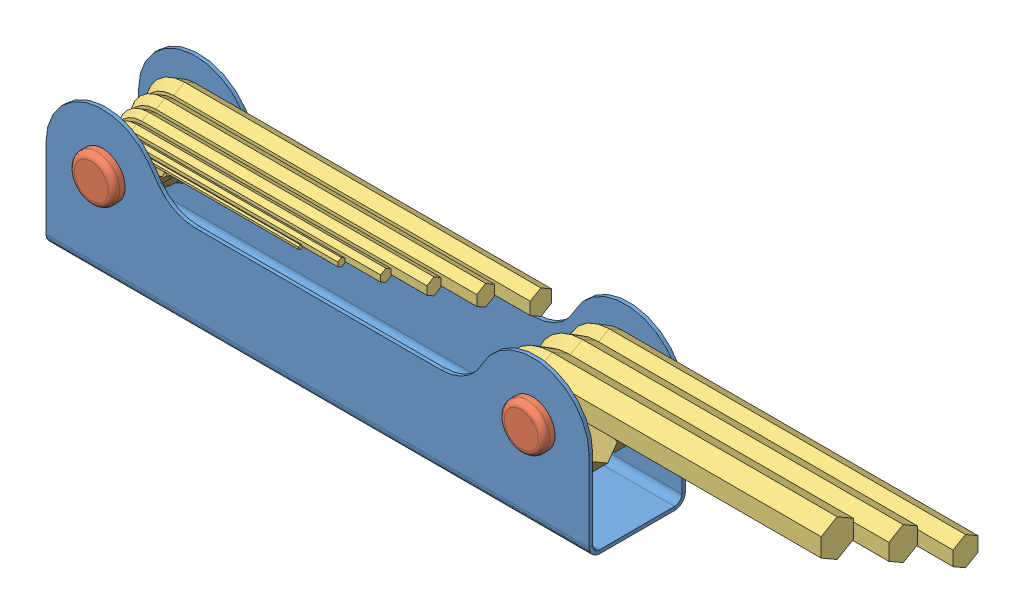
SolidWorks assembly part configs_&.SLDASM, configuration Exploded (file format 3100). Lengths in mm.
Overall size (236.53 41.27 38.17).
13 component instances, 4 part files, 36 mates.
Components (placement in the parent):
- Base Sheet Metal_&-1: Base Sheet Metal_&.SLDPRT [Default] at origin size (152.4 41.27 27)
- Pin_&-1: Pin_&.SLDPRT [Default] at (0 0 13.5) size (12.7 12.7 38.17)
- Pin_&-2: Pin_&.SLDPRT [Default] at (120.65 0 13.5) x (-0.979827 0.199848 0) z (0 0 1) size (12.7 12.7 38.17)
- Allen Wrench_&-1: Allen Wrench_&.SLDPRT [Size 6] at (0 0 -9.5) size (110.93 21.86 6)
- Allen Wrench_&-2: Allen Wrench_&.SLDPRT [Size 5] at (0 0 -4) size (99.77 19.55 5)
- Allen Wrench_&-3: Allen Wrench_&.SLDPRT [Size 4] at (0 0 0.5) size (88.62 17.24 4)
- Allen Wrench_&-4: Allen Wrench_&.SLDPRT [Size3] at (0 0 4) size (77.46 14.93 3)
- Washer_&-1: Washer_&.SLDPRT [Default] at (0 0 10.5) size (25 25 2)
- Allen Wrench_&-5: Allen Wrench_&.SLDPRT [Size2] at (0 0 6.5) size (66.31 12.62 2)
- Allen Wrench_&-6: Allen Wrench_&.SLDPRT [Size1] at (0 0 8) size (55.15 10.31 1)
- Allen Wrench_&-7: Allen Wrench_&.SLDPRT [Size7] at (120.65 0 -8) size (112.08 24.17 7)
- Allen Wrench_&-8: Allen Wrench_&.SLDPRT [Size8] at (120.65 0 -0.5) size (103.24 26.48 8)
- Allen Wrench_&-9: Allen Wrench_&.SLDPRT [Size9] at (120.65 0 8) size (94.39 28.78 9)
Mates (geometry in assembly coordinates):
- Coincident1: coincident aligned: plane of Base Sheet Metal_&-1; plane of assembly
- Coincident2: coincident aligned: plane of Base Sheet Metal_&-1; plane of assembly
- Coincident3: coincident aligned: plane of Base Sheet Metal_&-1; plane of assembly
- Coincident4: coincident aligned: axis of Base Sheet Metal_&-1; axis of Pin_&-1
- Coincident5: coincident anti-aligned: plane of Base Sheet Metal_&-1; plane of Pin_&-1
- Coincident6: coincident anti-aligned: axis of Base Sheet Metal_&-1; axis of Pin_&-2
- Coincident7: coincident anti-aligned: plane of Base Sheet Metal_&-1; plane of Pin_&-2
- Coincident8: coincident anti-aligned: axis of Pin_&-1; axis of Allen Wrench_&-1
- Coincident9: coincident anti-aligned: plane of Base Sheet Metal_&-1; plane of Allen Wrench_&-1
- Coincident10: coincident aligned: line of Allen Wrench_&-1; line of Allen Wrench_&-2
- Coincident11: coincident anti-aligned: plane of Allen Wrench_&-1; plane of Allen Wrench_&-2
- Coincident12: coincident aligned: line of Allen Wrench_&-2; line of Allen Wrench_&-3
- Coincident13: coincident anti-aligned: plane of Allen Wrench_&-2; plane of Allen Wrench_&-3
- Coincident14: coincident anti-aligned: plane of Allen Wrench_&-3; plane of Allen Wrench_&-4
- Coincident15: coincident aligned: line of Allen Wrench_&-2; line of Allen Wrench_&-4
- Coincident16: coincident aligned: line of Allen Wrench_&-4; axis of Washer_&-1
- Coincident17: coincident anti-aligned: plane of Base Sheet Metal_&-1; plane of Washer_&-1
- Coincident18: coincident aligned: line of Allen Wrench_&-3; line of Allen Wrench_&-5
- Coincident19: coincident anti-aligned: plane of Allen Wrench_&-4; plane of Allen Wrench_&-5
- Coincident20: coincident aligned: line of Allen Wrench_&-4; line of Allen Wrench_&-6
- Coincident21: coincident anti-aligned: plane of Allen Wrench_&-5; plane of Allen Wrench_&-6
- Coincident22: coincident anti-aligned: axis of Pin_&-2; axis of Allen Wrench_&-9
- Coincident23: coincident anti-aligned: plane of Base Sheet Metal_&-1; plane of Allen Wrench_&-9
- Coincident24: coincident anti-aligned: axis of Pin_&-2; axis of Allen Wrench_&-8
- Coincident25: coincident anti-aligned: plane of Allen Wrench_&-8; plane of Allen Wrench_&-9
- Coincident26: coincident anti-aligned: axis of Pin_&-2; axis of Allen Wrench_&-7
- Coincident27: coincident anti-aligned: plane of Allen Wrench_&-7; plane of Allen Wrench_&-8
- Parallel1: parallel anti-aligned: line of Base Sheet Metal_&-1; line of Allen Wrench_&-1
- Parallel2: parallel aligned: line of Allen Wrench_&-1; line of Allen Wrench_&-2
- Parallel3: parallel aligned: line of Allen Wrench_&-2; line of Allen Wrench_&-3
- Parallel4: parallel aligned: line of Allen Wrench_&-3; line of Allen Wrench_&-4
- Parallel5: parallel aligned: line of Allen Wrench_&-4; line of Allen Wrench_&-5
- Parallel6: parallel aligned: line of Allen Wrench_&-5; line of Allen Wrench_&-6
- Parallel7: parallel aligned: line of Allen Wrench_&-1; line of Allen Wrench_&-7
- Parallel8: parallel aligned: line of Allen Wrench_&-1; line of Allen Wrench_&-8
- Parallel9: parallel aligned: 
